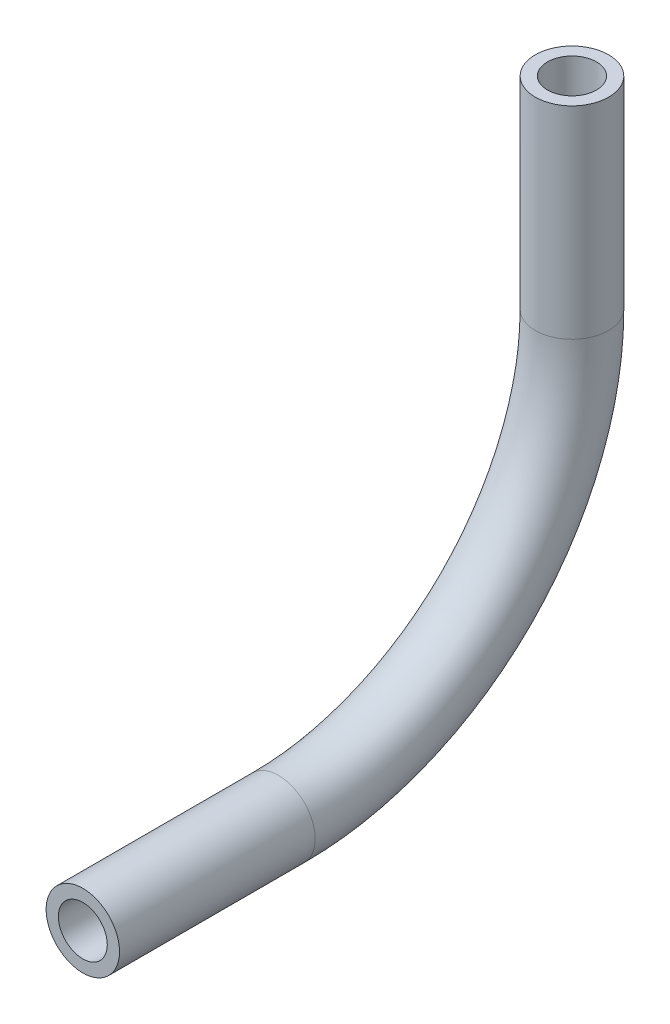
from build123d import *

# Parameters (mm, degrees)
SKETCH1_R   = 9.525
SKETCH1_R_2 = 6.35


with BuildPart() as part:
    # Sweep1: sweep along a path in Sketch2
    with BuildLine(Plane(origin=(0, 0, 0), x_dir=(0, 0, -1), z_dir=(1, 0, 0))) as sweep1_path:
        Line((0, 0), (50.8, 0))
        ThreePointArc((50.8, 0), (104.681536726, 22.318463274), (127, 76.2))
        Line((127, 76.2), (127, 128.680239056))
    # Sketch1 → Sweep1 (sweep)
    with BuildSketch(Plane.XY):
        Circle(SKETCH1_R)
        Circle(SKETCH1_R_2, mode=Mode.SUBTRACT)
    sweep(path=sweep1_path.line)


solid = part.part
